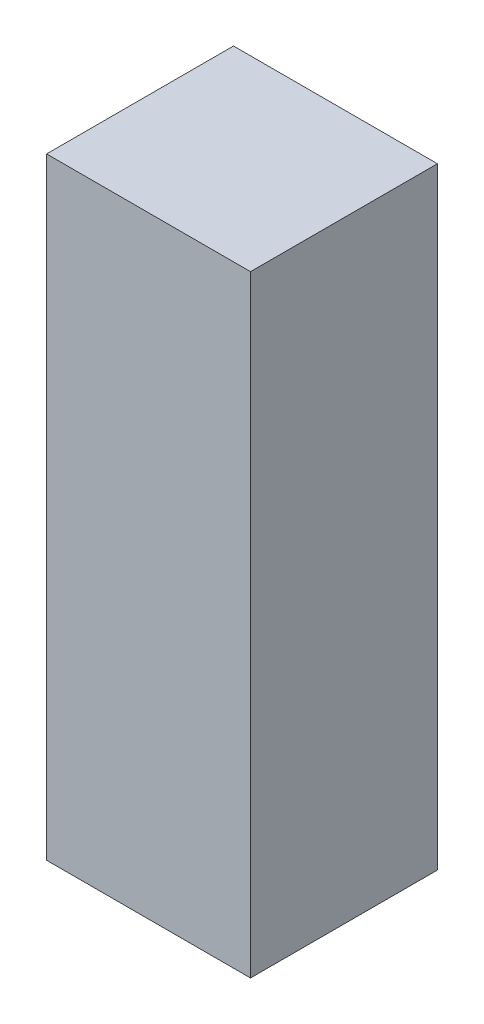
from build123d import *

# Parameters (mm, degrees)
SKETCH1_W           = 609.6
SKETCH1_H           = 558.8
BOSS_EXTRUDE1_DEPTH = 1828.8


with BuildPart() as part:
    # Sketch1 → Boss-Extrude1 (new body)
    with BuildSketch(Plane(origin=(0, 0, 0), x_dir=(1, 0, 0), z_dir=(0, 1, 0))):
        Rectangle(SKETCH1_W, SKETCH1_H)
    extrude(amount=BOSS_EXTRUDE1_DEPTH)


solid = part.part
